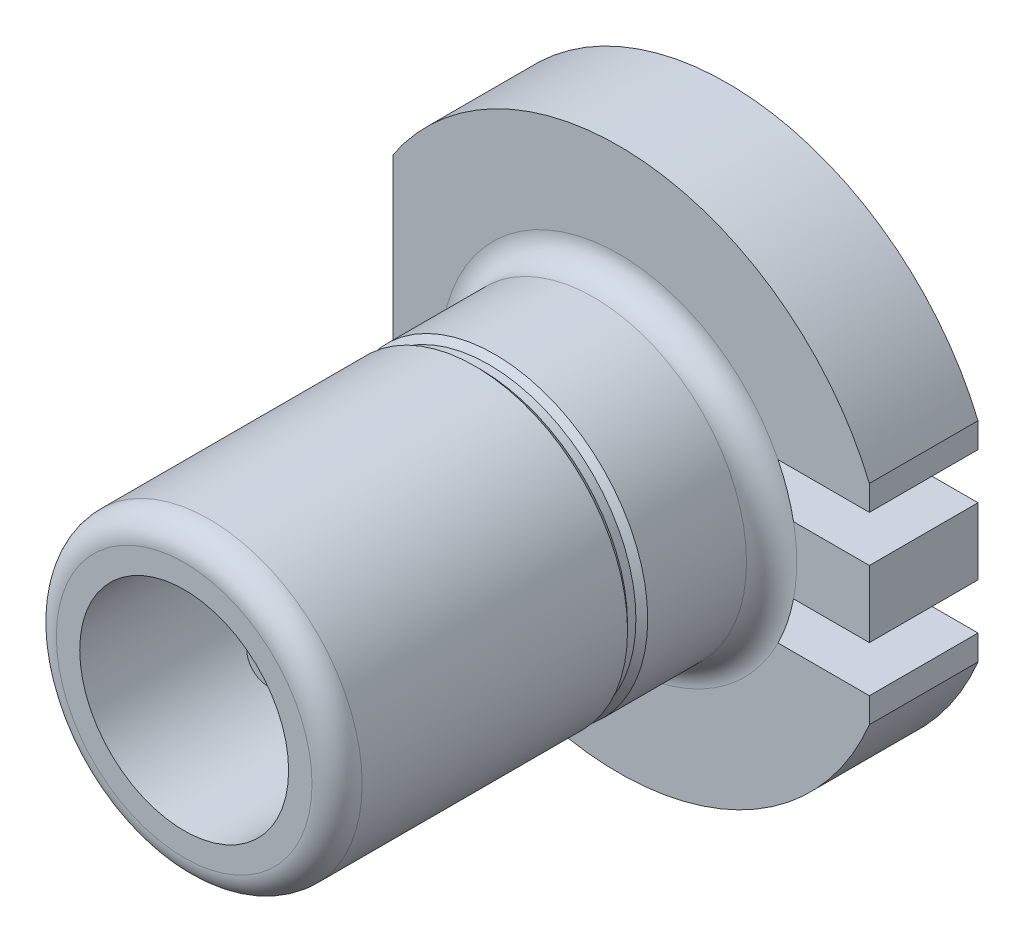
from build123d import *

# Parameters (mm, degrees)
BOSS_EXTRUDE1_DEPTH   = 1.3
SKETCH1_W             = 1.7
SKETCH1_H             = 0.8
BOSS_EXTRUDE1_2_DEPTH = 1.3
SKETCH3_R             = 1.25
CUT_EXTRUDE1_DEPTH    = 5
SKETCH4_R             = 0.25
BOSS_EXTRUDE2_DEPTH   = 4


with BuildPart() as part:
    # Sketch1 → Boss-Extrude1 (new body)
    with BuildSketch(Plane.XY):
        with BuildLine():
            Line((-2.7, 1.809005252), (-2.7, -1.809005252))
            ThreePointArc((-2.7, -1.809005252), (0.317209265, -3.234482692), (3, -1.25))
            Line((3, -1.25), (3, -0.95))
            Line((3, -0.95), (0.447213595, -0.95))
            ThreePointArc((0.447213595, -0.95), (-1.05, 0), (0.447213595, 0.95))
            Line((0.447213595, 0.95), (3, 0.95))
            Line((3, 0.95), (3, 1.25))
            ThreePointArc((3, 1.25), (0.317209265, 3.234482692), (-2.7, 1.809005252))
        make_face()
    extrude(amount=BOSS_EXTRUDE1_DEPTH)



with BuildPart() as body_2:
    # Sketch1 → Boss-Extrude1 2 (new body)
    with BuildSketch(Plane.XY):
        with Locations((2.15, 0)):
            Rectangle(SKETCH1_W, SKETCH1_H)
    extrude(amount=BOSS_EXTRUDE1_2_DEPTH)


with BuildPart() as part_1:
    add(part.part)

    add(body_2.part)  # Revolve1 merges body 2
    # Sketch2 → Revolve1 (revolve)
    with BuildSketch(Plane(origin=(0, 0, 0), x_dir=(1, 0, 0), z_dir=(0, 1, 0))):
        with BuildLine():
            Line((0, -1.3), (0, -6.5))
            Line((0, -6.5), (1.53, -6.5))
            ThreePointArc((1.53, -6.5), (1.742132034, -6.412132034), (1.83, -6.2))
            Line((1.83, -6.2), (1.83, -3.023801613))
            Line((1.83, -3.023801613), (1.759289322, -2.953090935))
            Line((1.759289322, -2.953090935), (1.759289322, -2.853090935))
            Line((1.759289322, -2.853090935), (1.83, -2.782380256))
            Line((1.83, -2.782380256), (1.83, -1.6))
            ThreePointArc((1.83, -1.6), (1.917867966, -1.387867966), (2.13, -1.3))
            Line((2.13, -1.3), (0, -1.3))
        make_face()
    revolve(axis=Axis((0, 0, 1.3), (0, 0, -1)))

    # Sketch3 → Cut-Extrude1 (cut)
    with BuildSketch(Plane.XY.offset(6.5)):
        Circle(SKETCH3_R)
    extrude(amount=-CUT_EXTRUDE1_DEPTH, mode=Mode.SUBTRACT)

    # Sketch4 → Boss-Extrude2 (add)
    with BuildSketch(Plane.XY.offset(1.5)):
        Circle(SKETCH4_R)
    extrude(amount=BOSS_EXTRUDE2_DEPTH)


solid = part_1.part
